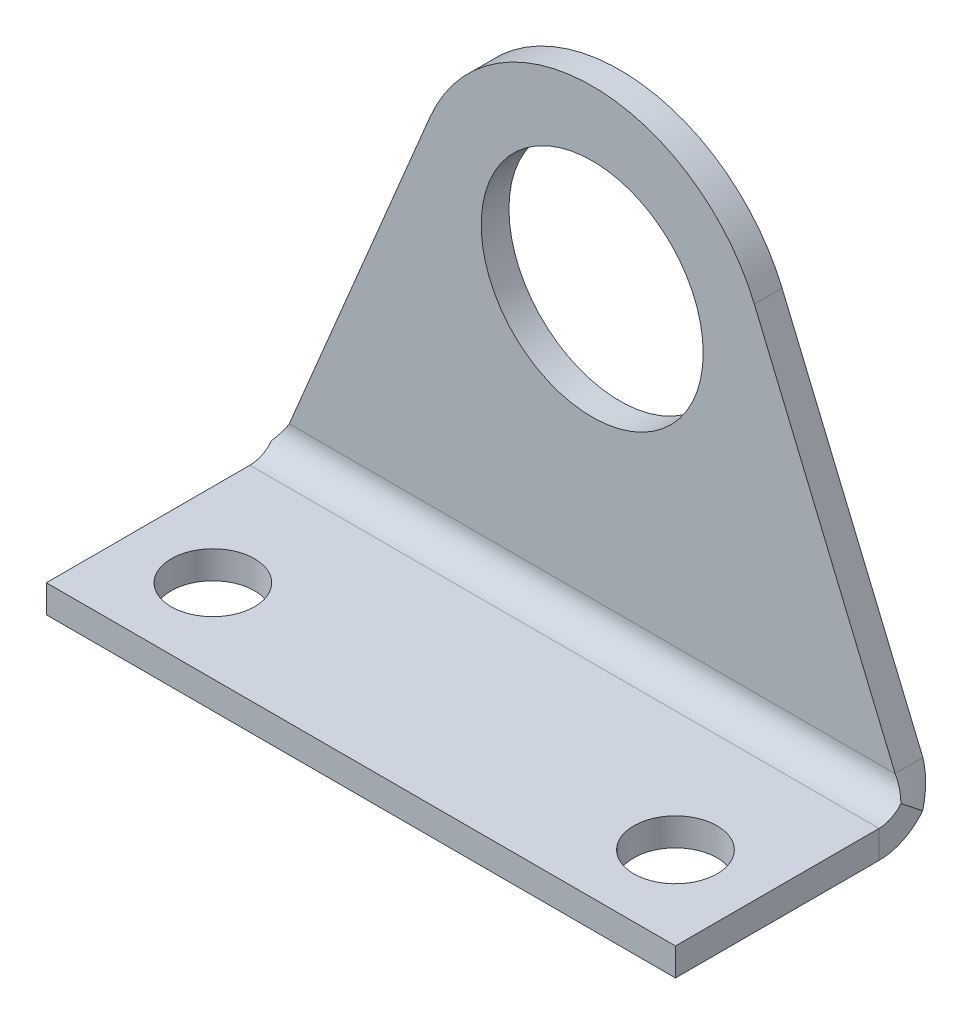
ISO-10303-21;
HEADER;
FILE_DESCRIPTION(('STEP AP214'),'2;1');
FILE_NAME('part.step','',(''),(''),'','','');
FILE_SCHEMA(('AUTOMOTIVE_DESIGN { 1 0 10303 214 1 1 1 1 }'));
ENDSEC;
DATA;
#1=APPLICATION_CONTEXT('core data for automotive mechanical design processes');
#2=APPLICATION_PROTOCOL_DEFINITION('international standard','automotive_design',2000,#1);
#3=PRODUCT_CONTEXT('',#1,'mechanical');
#4=PRODUCT('Part','Part','',(#3));
#5=PRODUCT_RELATED_PRODUCT_CATEGORY('part','',(#4));
#6=PRODUCT_DEFINITION_FORMATION('','',#4);
#7=PRODUCT_DEFINITION_CONTEXT('part definition',#1,'design');
#8=PRODUCT_DEFINITION('design','',#6,#7);
#9=PRODUCT_DEFINITION_SHAPE('','',#8);
#10=(LENGTH_UNIT() NAMED_UNIT(*) SI_UNIT(.MILLI.,.METRE.));
#11=(NAMED_UNIT(*) PLANE_ANGLE_UNIT() SI_UNIT($,.RADIAN.));
#12=(NAMED_UNIT(*) SI_UNIT($,.STERADIAN.) SOLID_ANGLE_UNIT());
#13=UNCERTAINTY_MEASURE_WITH_UNIT(LENGTH_MEASURE(1.E-05),#10,'distance_accuracy_value','');
#14=(GEOMETRIC_REPRESENTATION_CONTEXT(3) GLOBAL_UNCERTAINTY_ASSIGNED_CONTEXT((#13)) GLOBAL_UNIT_ASSIGNED_CONTEXT((#10,
#11,#12)) REPRESENTATION_CONTEXT('',''));
#15=CARTESIAN_POINT('',(0.,0.,0.));
#16=DIRECTION('',(0.,0.,1.));
#17=DIRECTION('',(1.,0.,0.));
#18=AXIS2_PLACEMENT_3D('',#15,#16,#17);
#19=CARTESIAN_POINT('',(17.,0.,82.6947319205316));
#20=DIRECTION('',(-0.922381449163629,-0.386280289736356,0.));
#21=DIRECTION('',(0.386280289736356,-0.922381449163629,0.));
#22=AXIS2_PLACEMENT_3D('',#19,#20,#21);
#23=PLANE('',#22);
#24=DIRECTION('',(-0.386280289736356,0.922381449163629,0.));
#25=VECTOR('',#24,1.);
#26=CARTESIAN_POINT('',(17.,0.,0.));
#27=LINE('',#26,#25);
#28=CARTESIAN_POINT('',(16.3718212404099,1.5,0.));
#29=VERTEX_POINT('',#28);
#30=CARTESIAN_POINT('',(8.76262376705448,19.6696627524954,0.));
#31=VERTEX_POINT('',#30);
#32=EDGE_CURVE('E50',#29,#31,#27,.T.);
#33=ORIENTED_EDGE('',*,*,#32,.T.);
#34=DIRECTION('',(0.,0.,-1.));
#35=VECTOR('',#34,1.);
#36=CARTESIAN_POINT('',(8.76262376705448,19.6696627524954,82.6947319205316));
#37=LINE('',#36,#35);
#38=CARTESIAN_POINT('',(8.76262376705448,19.6696627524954,1.5));
#39=VERTEX_POINT('',#38);
#40=EDGE_CURVE('E44',#39,#31,#37,.T.);
#41=ORIENTED_EDGE('',*,*,#40,.F.);
#42=DIRECTION('',(-0.386280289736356,0.922381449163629,0.));
#43=VECTOR('',#42,1.);
#44=CARTESIAN_POINT('',(17.,0.,1.5));
#45=LINE('',#44,#43);
#46=CARTESIAN_POINT('',(16.3718212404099,1.5,1.5));
#47=VERTEX_POINT('',#46);
#48=EDGE_CURVE('E316',#47,#39,#45,.T.);
#49=ORIENTED_EDGE('',*,*,#48,.F.);
#50=CARTESIAN_POINT('',(16.3718212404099,1.5,0.));
#51=CARTESIAN_POINT('',(16.3718212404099,1.5,1.5));
#52=B_SPLINE_CURVE_WITH_KNOTS('',1,(#50,#51),.UNSPECIFIED.,.F.,.F.,(2,2),(0.,1.),.UNSPECIFIED.);
#53=EDGE_CURVE('E11',#47,#29,#52,.F.);
#54=ORIENTED_EDGE('',*,*,#53,.T.);
#55=EDGE_LOOP('',(#33,#41,#49,#54));
#56=FACE_BOUND('',#55,.T.);
#57=ADVANCED_FACE('F35',(#56),#23,.F.);
#58=CARTESIAN_POINT('',(0.,16.,82.6947319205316));
#59=DIRECTION('',(0.,0.,-1.));
#60=DIRECTION('',(0.,1.,0.));
#61=AXIS2_PLACEMENT_3D('',#58,#59,#60);
#62=CYLINDRICAL_SURFACE('',#61,9.5);
#63=CARTESIAN_POINT('',(0.,16.,0.));
#64=DIRECTION('',(0.,0.,1.));
#65=DIRECTION('',(-1.,0.,0.));
#66=AXIS2_PLACEMENT_3D('',#63,#64,#65);
#67=CIRCLE('',#66,9.5);
#68=CARTESIAN_POINT('',(-8.76262376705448,19.6696627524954,0.));
#69=VERTEX_POINT('',#68);
#70=EDGE_CURVE('E310',#31,#69,#67,.T.);
#71=ORIENTED_EDGE('',*,*,#70,.T.);
#72=DIRECTION('',(0.,0.,-1.));
#73=VECTOR('',#72,1.);
#74=CARTESIAN_POINT('',(-8.76262376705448,19.6696627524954,82.6947319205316));
#75=LINE('',#74,#73);
#76=CARTESIAN_POINT('',(-8.76262376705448,19.6696627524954,1.5));
#77=VERTEX_POINT('',#76);
#78=EDGE_CURVE('E323',#77,#69,#75,.T.);
#79=ORIENTED_EDGE('',*,*,#78,.F.);
#80=CARTESIAN_POINT('',(0.,16.,1.5));
#81=DIRECTION('',(0.,0.,1.));
#82=DIRECTION('',(-1.,0.,0.));
#83=AXIS2_PLACEMENT_3D('',#80,#81,#82);
#84=CIRCLE('',#83,9.5);
#85=EDGE_CURVE('E58',#39,#77,#84,.T.);
#86=ORIENTED_EDGE('',*,*,#85,.F.);
#87=ORIENTED_EDGE('',*,*,#40,.T.);
#88=EDGE_LOOP('',(#71,#79,#86,#87));
#89=FACE_BOUND('',#88,.T.);
#90=ADVANCED_FACE('F366',(#89),#62,.T.);
#91=CARTESIAN_POINT('',(-8.76262376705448,19.6696627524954,82.6947319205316));
#92=DIRECTION('',(0.922381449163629,-0.386280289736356,0.));
#93=DIRECTION('',(0.386280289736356,0.922381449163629,0.));
#94=AXIS2_PLACEMENT_3D('',#91,#92,#93);
#95=PLANE('',#94);
#96=DIRECTION('',(-0.386280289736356,-0.922381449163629,0.));
#97=VECTOR('',#96,1.);
#98=CARTESIAN_POINT('',(-8.76262376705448,19.6696627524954,0.));
#99=LINE('',#98,#97);
#100=CARTESIAN_POINT('',(-16.3718212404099,1.49999999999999,0.));
#101=VERTEX_POINT('',#100);
#102=EDGE_CURVE('E328',#69,#101,#99,.T.);
#103=ORIENTED_EDGE('',*,*,#102,.T.);
#104=CARTESIAN_POINT('',(-16.3718212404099,1.5,1.5));
#105=CARTESIAN_POINT('',(-16.3718212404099,1.49999999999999,0.));
#106=B_SPLINE_CURVE_WITH_KNOTS('',1,(#104,#105),.UNSPECIFIED.,.F.,.F.,(2,2),(0.,1.),.UNSPECIFIED.);
#107=CARTESIAN_POINT('',(-16.3718212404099,1.5,1.5));
#108=VERTEX_POINT('',#107);
#109=EDGE_CURVE('E325',#108,#101,#106,.T.);
#110=ORIENTED_EDGE('',*,*,#109,.F.);
#111=DIRECTION('',(-0.386280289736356,-0.922381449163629,0.));
#112=VECTOR('',#111,1.);
#113=CARTESIAN_POINT('',(-8.76262376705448,19.6696627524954,1.5));
#114=LINE('',#113,#112);
#115=EDGE_CURVE('E314',#77,#108,#114,.T.);
#116=ORIENTED_EDGE('',*,*,#115,.F.);
#117=ORIENTED_EDGE('',*,*,#78,.T.);
#118=EDGE_LOOP('',(#103,#110,#116,#117));
#119=FACE_BOUND('',#118,.T.);
#120=ADVANCED_FACE('F356',(#119),#95,.F.);
#121=CARTESIAN_POINT('',(0.,16.,1.5));
#122=DIRECTION('',(0.,0.,-1.));
#123=DIRECTION('',(-1.,0.,0.));
#124=AXIS2_PLACEMENT_3D('',#121,#122,#123);
#125=PLANE('',#124);
#126=CARTESIAN_POINT('',(0.,16.,1.5));
#127=DIRECTION('',(0.,0.,1.));
#128=DIRECTION('',(1.,0.,0.));
#129=AXIS2_PLACEMENT_3D('',#126,#127,#128);
#130=CIRCLE('',#129,6.);
#131=CARTESIAN_POINT('',(6.,16.,1.5));
#132=VERTEX_POINT('',#131);
#133=EDGE_CURVE('E382',#132,#132,#130,.T.);
#134=ORIENTED_EDGE('',*,*,#133,.F.);
#135=EDGE_LOOP('',(#134));
#136=FACE_BOUND('',#135,.T.);
#137=ORIENTED_EDGE('',*,*,#115,.T.);
#138=DIRECTION('',(1.,0.,0.));
#139=VECTOR('',#138,1.);
#140=CARTESIAN_POINT('',(16.3718212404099,1.5,1.5));
#141=LINE('',#140,#139);
#142=EDGE_CURVE('E322',#108,#47,#141,.T.);
#143=ORIENTED_EDGE('',*,*,#142,.T.);
#144=ORIENTED_EDGE('',*,*,#48,.T.);
#145=ORIENTED_EDGE('',*,*,#85,.T.);
#146=EDGE_LOOP('',(#137,#143,#144,#145));
#147=FACE_BOUND('',#146,.T.);
#148=ADVANCED_FACE('F365',(#136,#147),#125,.F.);
#149=CARTESIAN_POINT('',(0.,16.,0.));
#150=DIRECTION('',(0.,0.,-1.));
#151=DIRECTION('',(-1.,0.,0.));
#152=AXIS2_PLACEMENT_3D('',#149,#150,#151);
#153=PLANE('',#152);
#154=CARTESIAN_POINT('',(0.,16.,0.));
#155=DIRECTION('',(0.,0.,-1.));
#156=DIRECTION('',(-1.,0.,0.));
#157=AXIS2_PLACEMENT_3D('',#154,#155,#156);
#158=CIRCLE('',#157,6.);
#159=CARTESIAN_POINT('',(-6.,16.,0.));
#160=VERTEX_POINT('',#159);
#161=EDGE_CURVE('E379',#160,#160,#158,.T.);
#162=ORIENTED_EDGE('',*,*,#161,.F.);
#163=EDGE_LOOP('',(#162));
#164=FACE_BOUND('',#163,.T.);
#165=DIRECTION('',(1.,0.,0.));
#166=VECTOR('',#165,1.);
#167=CARTESIAN_POINT('',(16.3718212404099,1.5,0.));
#168=LINE('',#167,#166);
#169=EDGE_CURVE('E140',#101,#29,#168,.T.);
#170=ORIENTED_EDGE('',*,*,#169,.F.);
#171=ORIENTED_EDGE('',*,*,#102,.F.);
#172=ORIENTED_EDGE('',*,*,#70,.F.);
#173=ORIENTED_EDGE('',*,*,#32,.F.);
#174=EDGE_LOOP('',(#170,#171,#172,#173));
#175=FACE_BOUND('',#174,.T.);
#176=ADVANCED_FACE('F377',(#164,#175),#153,.T.);
#177=CARTESIAN_POINT('',(17.,71.4702735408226,14.));
#178=DIRECTION('',(-1.,0.,0.));
#179=DIRECTION('',(0.,0.,1.));
#180=AXIS2_PLACEMENT_3D('',#177,#178,#179);
#181=PLANE('',#180);
#182=DIRECTION('',(0.,0.,-1.));
#183=VECTOR('',#182,1.);
#184=CARTESIAN_POINT('',(17.,-1.5,14.));
#185=LINE('',#184,#183);
#186=CARTESIAN_POINT('',(17.,-1.5,14.));
#187=VERTEX_POINT('',#186);
#188=CARTESIAN_POINT('',(17.,-1.5,3.));
#189=VERTEX_POINT('',#188);
#190=EDGE_CURVE('E269',#187,#189,#185,.T.);
#191=ORIENTED_EDGE('',*,*,#190,.T.);
#192=DIRECTION('',(0.,-1.,0.));
#193=VECTOR('',#192,1.);
#194=CARTESIAN_POINT('',(17.,71.4702735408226,3.));
#195=LINE('',#194,#193);
#196=CARTESIAN_POINT('',(17.,0.,3.));
#197=VERTEX_POINT('',#196);
#198=EDGE_CURVE('E147',#197,#189,#195,.T.);
#199=ORIENTED_EDGE('',*,*,#198,.F.);
#200=DIRECTION('',(0.,0.,-1.));
#201=VECTOR('',#200,1.);
#202=CARTESIAN_POINT('',(17.,0.,14.));
#203=LINE('',#202,#201);
#204=CARTESIAN_POINT('',(17.,0.,14.));
#205=VERTEX_POINT('',#204);
#206=EDGE_CURVE('E293',#205,#197,#203,.T.);
#207=ORIENTED_EDGE('',*,*,#206,.F.);
#208=DIRECTION('',(0.,-1.,0.));
#209=VECTOR('',#208,1.);
#210=CARTESIAN_POINT('',(17.,71.4702735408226,14.));
#211=LINE('',#210,#209);
#212=EDGE_CURVE('E301',#205,#187,#211,.T.);
#213=ORIENTED_EDGE('',*,*,#212,.T.);
#214=EDGE_LOOP('',(#191,#199,#207,#213));
#215=FACE_BOUND('',#214,.T.);
#216=ADVANCED_FACE('F416',(#215),#181,.F.);
#217=CARTESIAN_POINT('',(-17.,71.4702735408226,14.));
#218=DIRECTION('',(-1.,0.,0.));
#219=DIRECTION('',(0.,0.,1.));
#220=AXIS2_PLACEMENT_3D('',#217,#218,#219);
#221=PLANE('',#220);
#222=DIRECTION('',(0.,-1.,0.));
#223=VECTOR('',#222,1.);
#224=CARTESIAN_POINT('',(-17.,71.4702735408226,3.));
#225=LINE('',#224,#223);
#226=CARTESIAN_POINT('',(-17.,0.,3.));
#227=VERTEX_POINT('',#226);
#228=CARTESIAN_POINT('',(-17.,-1.5,3.));
#229=VERTEX_POINT('',#228);
#230=EDGE_CURVE('E306',#227,#229,#225,.T.);
#231=ORIENTED_EDGE('',*,*,#230,.T.);
#232=DIRECTION('',(0.,0.,-1.));
#233=VECTOR('',#232,1.);
#234=CARTESIAN_POINT('',(-17.,-1.5,14.));
#235=LINE('',#234,#233);
#236=CARTESIAN_POINT('',(-17.,-1.5,14.));
#237=VERTEX_POINT('',#236);
#238=EDGE_CURVE('E280',#237,#229,#235,.T.);
#239=ORIENTED_EDGE('',*,*,#238,.F.);
#240=DIRECTION('',(0.,-1.,0.));
#241=VECTOR('',#240,1.);
#242=CARTESIAN_POINT('',(-17.,71.4702735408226,14.));
#243=LINE('',#242,#241);
#244=CARTESIAN_POINT('',(-17.,0.,14.));
#245=VERTEX_POINT('',#244);
#246=EDGE_CURVE('E304',#245,#237,#243,.T.);
#247=ORIENTED_EDGE('',*,*,#246,.F.);
#248=DIRECTION('',(0.,0.,-1.));
#249=VECTOR('',#248,1.);
#250=CARTESIAN_POINT('',(-17.,0.,14.));
#251=LINE('',#250,#249);
#252=EDGE_CURVE('E285',#245,#227,#251,.T.);
#253=ORIENTED_EDGE('',*,*,#252,.T.);
#254=EDGE_LOOP('',(#231,#239,#247,#253));
#255=FACE_BOUND('',#254,.T.);
#256=ADVANCED_FACE('F411',(#255),#221,.T.);
#257=CARTESIAN_POINT('',(-17.,71.4702735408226,14.));
#258=DIRECTION('',(0.,0.,-1.));
#259=DIRECTION('',(-1.,0.,0.));
#260=AXIS2_PLACEMENT_3D('',#257,#258,#259);
#261=PLANE('',#260);
#262=DIRECTION('',(-1.,0.,0.));
#263=VECTOR('',#262,1.);
#264=CARTESIAN_POINT('',(-17.,-1.5,14.));
#265=LINE('',#264,#263);
#266=EDGE_CURVE('E277',#187,#237,#265,.T.);
#267=ORIENTED_EDGE('',*,*,#266,.F.);
#268=ORIENTED_EDGE('',*,*,#212,.F.);
#269=DIRECTION('',(1.,0.,0.));
#270=VECTOR('',#269,1.);
#271=CARTESIAN_POINT('',(-17.,0.,14.));
#272=LINE('',#271,#270);
#273=EDGE_CURVE('E288',#245,#205,#272,.T.);
#274=ORIENTED_EDGE('',*,*,#273,.F.);
#275=ORIENTED_EDGE('',*,*,#246,.T.);
#276=EDGE_LOOP('',(#267,#268,#274,#275));
#277=FACE_BOUND('',#276,.T.);
#278=ADVANCED_FACE('F418',(#277),#261,.F.);
#279=CARTESIAN_POINT('',(-17.,0.,14.));
#280=DIRECTION('',(0.,1.,0.));
#281=DIRECTION('',(0.,0.,1.));
#282=AXIS2_PLACEMENT_3D('',#279,#280,#281);
#283=PLANE('',#282);
#284=CARTESIAN_POINT('',(12.5,0.,9.5));
#285=DIRECTION('',(0.,1.,0.));
#286=DIRECTION('',(0.,0.,1.));
#287=AXIS2_PLACEMENT_3D('',#284,#285,#286);
#288=CIRCLE('',#287,2.25);
#289=CARTESIAN_POINT('',(12.5,0.,11.75));
#290=VERTEX_POINT('',#289);
#291=EDGE_CURVE('E391',#290,#290,#288,.T.);
#292=ORIENTED_EDGE('',*,*,#291,.F.);
#293=EDGE_LOOP('',(#292));
#294=FACE_BOUND('',#293,.T.);
#295=CARTESIAN_POINT('',(-12.5,0.,9.5));
#296=DIRECTION('',(0.,1.,0.));
#297=DIRECTION('',(0.,0.,1.));
#298=AXIS2_PLACEMENT_3D('',#295,#296,#297);
#299=CIRCLE('',#298,2.25);
#300=CARTESIAN_POINT('',(-12.5,0.,11.75));
#301=VERTEX_POINT('',#300);
#302=EDGE_CURVE('E388',#301,#301,#299,.T.);
#303=ORIENTED_EDGE('',*,*,#302,.F.);
#304=EDGE_LOOP('',(#303));
#305=FACE_BOUND('',#304,.T.);
#306=ORIENTED_EDGE('',*,*,#206,.T.);
#307=DIRECTION('',(-1.,0.,0.));
#308=VECTOR('',#307,1.);
#309=CARTESIAN_POINT('',(17.,0.,3.));
#310=LINE('',#309,#308);
#311=EDGE_CURVE('E296',#197,#227,#310,.T.);
#312=ORIENTED_EDGE('',*,*,#311,.T.);
#313=ORIENTED_EDGE('',*,*,#252,.F.);
#314=ORIENTED_EDGE('',*,*,#273,.T.);
#315=EDGE_LOOP('',(#306,#312,#313,#314));
#316=FACE_BOUND('',#315,.T.);
#317=ADVANCED_FACE('F403',(#294,#305,#316),#283,.T.);
#318=CARTESIAN_POINT('',(-17.,-1.5,14.));
#319=DIRECTION('',(0.,-1.,0.));
#320=DIRECTION('',(1.,0.,0.));
#321=AXIS2_PLACEMENT_3D('',#318,#319,#320);
#322=PLANE('',#321);
#323=CARTESIAN_POINT('',(12.5,-1.5,9.5));
#324=DIRECTION('',(0.,-1.,0.));
#325=DIRECTION('',(1.,0.,0.));
#326=AXIS2_PLACEMENT_3D('',#323,#324,#325);
#327=CIRCLE('',#326,2.25);
#328=CARTESIAN_POINT('',(14.75,-1.5,9.5));
#329=VERTEX_POINT('',#328);
#330=EDGE_CURVE('E39',#329,#329,#327,.T.);
#331=ORIENTED_EDGE('',*,*,#330,.F.);
#332=EDGE_LOOP('',(#331));
#333=FACE_BOUND('',#332,.T.);
#334=CARTESIAN_POINT('',(-12.5,-1.5,9.5));
#335=DIRECTION('',(0.,-1.,0.));
#336=DIRECTION('',(1.,0.,0.));
#337=AXIS2_PLACEMENT_3D('',#334,#335,#336);
#338=CIRCLE('',#337,2.25);
#339=CARTESIAN_POINT('',(-10.25,-1.5,9.5));
#340=VERTEX_POINT('',#339);
#341=EDGE_CURVE('E387',#340,#340,#338,.T.);
#342=ORIENTED_EDGE('',*,*,#341,.F.);
#343=EDGE_LOOP('',(#342));
#344=FACE_BOUND('',#343,.T.);
#345=ORIENTED_EDGE('',*,*,#238,.T.);
#346=DIRECTION('',(1.,0.,0.));
#347=VECTOR('',#346,1.);
#348=CARTESIAN_POINT('',(17.,-1.5,3.));
#349=LINE('',#348,#347);
#350=EDGE_CURVE('E283',#229,#189,#349,.T.);
#351=ORIENTED_EDGE('',*,*,#350,.T.);
#352=ORIENTED_EDGE('',*,*,#190,.F.);
#353=ORIENTED_EDGE('',*,*,#266,.T.);
#354=EDGE_LOOP('',(#345,#351,#352,#353));
#355=FACE_BOUND('',#354,.T.);
#356=ADVANCED_FACE('F400',(#333,#344,#355),#322,.T.);
#357=CARTESIAN_POINT('',(-17.,1.5,3.));
#358=DIRECTION('',(-1.,0.,0.));
#359=DIRECTION('',(0.,-1.,0.));
#360=AXIS2_PLACEMENT_3D('',#357,#358,#359);
#361=PLANE('',#360);
#362=ORIENTED_EDGE('',*,*,#230,.F.);
#363=CARTESIAN_POINT('',(-17.,1.5,3.));
#364=DIRECTION('',(-1.,0.,0.));
#365=DIRECTION('',(0.,0.,1.));
#366=AXIS2_PLACEMENT_3D('',#363,#364,#365);
#367=CIRCLE('',#366,1.5);
#368=CARTESIAN_POINT('',(-17.,0.572445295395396,1.82116910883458));
#369=VERTEX_POINT('',#368);
#370=EDGE_CURVE('E148',#227,#369,#367,.F.);
#371=ORIENTED_EDGE('',*,*,#370,.T.);
#372=CARTESIAN_POINT('',(-17.,-0.355109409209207,0.642338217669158));
#373=CARTESIAN_POINT('',(-17.,0.572445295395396,1.82116910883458));
#374=B_SPLINE_CURVE_WITH_KNOTS('',1,(#372,#373),.UNSPECIFIED.,.F.,.F.,(2,2),(0.,1.),.UNSPECIFIED.);
#375=CARTESIAN_POINT('',(-17.,-0.355109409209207,0.642338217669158));
#376=VERTEX_POINT('',#375);
#377=EDGE_CURVE('E128',#369,#376,#374,.F.);
#378=ORIENTED_EDGE('',*,*,#377,.T.);
#379=CARTESIAN_POINT('',(-17.,1.5,3.));
#380=DIRECTION('',(-1.,0.,0.));
#381=DIRECTION('',(0.,0.,1.));
#382=AXIS2_PLACEMENT_3D('',#379,#380,#381);
#383=CIRCLE('',#382,3.);
#384=EDGE_CURVE('E129',#229,#376,#383,.F.);
#385=ORIENTED_EDGE('',*,*,#384,.F.);
#386=EDGE_LOOP('',(#362,#371,#378,#385));
#387=FACE_BOUND('',#386,.T.);
#388=ADVANCED_FACE('F227',(#387),#361,.T.);
#389=CARTESIAN_POINT('',(-17.,-0.355109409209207,0.642338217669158));
#390=CARTESIAN_POINT('',(-16.8952945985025,-0.0931246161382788,0.436197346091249));
#391=CARTESIAN_POINT('',(-16.7906070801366,0.203430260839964,0.274194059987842));
#392=CARTESIAN_POINT('',(-16.5812141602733,0.833401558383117,0.0560642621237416));
#393=CARTESIAN_POINT('',(-16.4765266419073,1.16663819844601,0.));
#394=CARTESIAN_POINT('',(-16.3718212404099,1.49999999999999,0.));
#395=CARTESIAN_POINT('',(-17.,0.572445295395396,1.82116910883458));
#396=CARTESIAN_POINT('',(-16.8952964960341,0.703435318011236,1.7181005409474));
#397=CARTESIAN_POINT('',(-16.7906070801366,0.851715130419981,1.63709702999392));
#398=CARTESIAN_POINT('',(-16.5812141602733,1.16670077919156,1.52803213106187));
#399=CARTESIAN_POINT('',(-16.4765247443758,1.33332211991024,1.5));
#400=CARTESIAN_POINT('',(-16.3718212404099,1.5,1.5));
#401=B_SPLINE_SURFACE_WITH_KNOTS('',1,3,((#389,#390,#391,#392,#393,#394),(#395,#396,#397,#398,
#399,#400)),.UNSPECIFIED.,.F.,.F.,.F.,(2,2),(4,2,4),(0.,1.),(0.,0.5,1.),.UNSPECIFIED.);
#402=CARTESIAN_POINT('',(-17.,0.572445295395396,1.82116910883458));
#403=CARTESIAN_POINT('',(-16.8952964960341,0.703435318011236,1.7181005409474));
#404=CARTESIAN_POINT('',(-16.7906070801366,0.851715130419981,1.63709702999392));
#405=CARTESIAN_POINT('',(-16.5812141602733,1.16670077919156,1.52803213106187));
#406=CARTESIAN_POINT('',(-16.4765247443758,1.33332211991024,1.5));
#407=CARTESIAN_POINT('',(-16.3718212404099,1.5,1.5));
#408=B_SPLINE_CURVE_WITH_KNOTS('',3,(#402,#403,#404,#405,#406,#407),.UNSPECIFIED.,.F.,.F.,(4,2,
4),(0.,0.5,1.),.UNSPECIFIED.);
#409=EDGE_CURVE('E151',#369,#108,#408,.T.);
#410=CARTESIAN_POINT('',(-16.3718212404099,1.49999999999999,0.));
#411=CARTESIAN_POINT('',(-16.4765266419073,1.16663819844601,0.));
#412=CARTESIAN_POINT('',(-16.5812141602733,0.833401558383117,0.0560642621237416));
#413=CARTESIAN_POINT('',(-16.7906070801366,0.203430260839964,0.274194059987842));
#414=CARTESIAN_POINT('',(-16.8952945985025,-0.0931246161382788,0.436197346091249));
#415=CARTESIAN_POINT('',(-17.,-0.355109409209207,0.642338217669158));
#416=B_SPLINE_CURVE_WITH_KNOTS('',3,(#410,#411,#412,#413,#414,#415),.UNSPECIFIED.,.F.,.F.,(4,2,
4),(0.,0.5,1.),.UNSPECIFIED.);
#417=EDGE_CURVE('E141',#376,#101,#416,.F.);
#418=ORIENTED_EDGE('',*,*,#377,.F.);
#419=ORIENTED_EDGE('',*,*,#409,.T.);
#420=ORIENTED_EDGE('',*,*,#109,.T.);
#421=ORIENTED_EDGE('',*,*,#417,.F.);
#422=EDGE_LOOP('',(#418,#419,#420,#421));
#423=FACE_BOUND('',#422,.T.);
#424=ADVANCED_FACE('F216',(#423),#401,.T.);
#425=CARTESIAN_POINT('',(16.3718212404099,1.5,0.));
#426=CARTESIAN_POINT('',(16.4765266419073,1.16663819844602,0.));
#427=CARTESIAN_POINT('',(16.5812141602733,0.833401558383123,0.0560642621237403));
#428=CARTESIAN_POINT('',(16.7906070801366,0.203430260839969,0.27419405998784));
#429=CARTESIAN_POINT('',(16.8952945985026,-0.0931246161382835,0.436197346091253));
#430=CARTESIAN_POINT('',(17.,-0.355109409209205,0.642338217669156));
#431=CARTESIAN_POINT('',(16.3718212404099,1.5,1.5));
#432=CARTESIAN_POINT('',(16.4765247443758,1.33332211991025,1.5));
#433=CARTESIAN_POINT('',(16.5812141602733,1.16670077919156,1.52803213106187));
#434=CARTESIAN_POINT('',(16.7906070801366,0.851715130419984,1.63709702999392));
#435=CARTESIAN_POINT('',(16.8952964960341,0.703435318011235,1.7181005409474));
#436=CARTESIAN_POINT('',(17.,0.572445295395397,1.82116910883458));
#437=B_SPLINE_SURFACE_WITH_KNOTS('',1,3,((#425,#426,#427,#428,#429,#430),(#431,#432,#433,#434,
#435,#436)),.UNSPECIFIED.,.F.,.F.,.F.,(2,2),(4,2,4),(0.,1.),(0.,0.5,1.),.UNSPECIFIED.);
#438=CARTESIAN_POINT('',(16.3718212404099,1.5,1.5));
#439=CARTESIAN_POINT('',(16.4765247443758,1.33332211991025,1.5));
#440=CARTESIAN_POINT('',(16.5812141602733,1.16670077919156,1.52803213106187));
#441=CARTESIAN_POINT('',(16.7906070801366,0.851715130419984,1.63709702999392));
#442=CARTESIAN_POINT('',(16.8952964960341,0.703435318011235,1.7181005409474));
#443=CARTESIAN_POINT('',(17.,0.572445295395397,1.82116910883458));
#444=B_SPLINE_CURVE_WITH_KNOTS('',3,(#438,#439,#440,#441,#442,#443),.UNSPECIFIED.,.F.,.F.,(4,2,
4),(0.,0.5,1.),.UNSPECIFIED.);
#445=CARTESIAN_POINT('',(17.,0.572445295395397,1.82116910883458));
#446=VERTEX_POINT('',#445);
#447=EDGE_CURVE('E122',#47,#446,#444,.T.);
#448=CARTESIAN_POINT('',(17.,0.572445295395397,1.82116910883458));
#449=CARTESIAN_POINT('',(17.,-0.355109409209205,0.642338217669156));
#450=B_SPLINE_CURVE_WITH_KNOTS('',1,(#448,#449),.UNSPECIFIED.,.F.,.F.,(2,2),(0.,1.),.UNSPECIFIED.);
#451=CARTESIAN_POINT('',(17.,-0.355109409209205,0.642338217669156));
#452=VERTEX_POINT('',#451);
#453=EDGE_CURVE('E114',#446,#452,#450,.T.);
#454=CARTESIAN_POINT('',(17.,-0.355109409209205,0.642338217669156));
#455=CARTESIAN_POINT('',(16.8952945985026,-0.0931246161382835,0.436197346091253));
#456=CARTESIAN_POINT('',(16.7906070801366,0.203430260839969,0.27419405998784));
#457=CARTESIAN_POINT('',(16.5812141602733,0.833401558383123,0.0560642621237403));
#458=CARTESIAN_POINT('',(16.4765266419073,1.16663819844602,0.));
#459=CARTESIAN_POINT('',(16.3718212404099,1.5,0.));
#460=B_SPLINE_CURVE_WITH_KNOTS('',3,(#454,#455,#456,#457,#458,#459),.UNSPECIFIED.,.F.,.F.,(4,2,
4),(0.,0.5,1.),.UNSPECIFIED.);
#461=EDGE_CURVE('E118',#29,#452,#460,.F.);
#462=ORIENTED_EDGE('',*,*,#53,.F.);
#463=ORIENTED_EDGE('',*,*,#447,.T.);
#464=ORIENTED_EDGE('',*,*,#453,.T.);
#465=ORIENTED_EDGE('',*,*,#461,.F.);
#466=EDGE_LOOP('',(#462,#463,#464,#465));
#467=FACE_BOUND('',#466,.T.);
#468=ADVANCED_FACE('F117',(#467),#437,.T.);
#469=CARTESIAN_POINT('',(17.,1.5,3.));
#470=DIRECTION('',(1.,0.,0.));
#471=DIRECTION('',(0.,1.,0.));
#472=AXIS2_PLACEMENT_3D('',#469,#470,#471);
#473=PLANE('',#472);
#474=ORIENTED_EDGE('',*,*,#453,.F.);
#475=CARTESIAN_POINT('',(17.,1.5,3.));
#476=DIRECTION('',(-1.,0.,0.));
#477=DIRECTION('',(0.,0.,1.));
#478=AXIS2_PLACEMENT_3D('',#475,#476,#477);
#479=CIRCLE('',#478,1.5);
#480=EDGE_CURVE('E378',#446,#197,#479,.T.);
#481=ORIENTED_EDGE('',*,*,#480,.T.);
#482=ORIENTED_EDGE('',*,*,#198,.T.);
#483=CARTESIAN_POINT('',(17.,1.5,3.));
#484=DIRECTION('',(-1.,0.,0.));
#485=DIRECTION('',(0.,0.,1.));
#486=AXIS2_PLACEMENT_3D('',#483,#484,#485);
#487=CIRCLE('',#486,3.);
#488=EDGE_CURVE('E136',#452,#189,#487,.T.);
#489=ORIENTED_EDGE('',*,*,#488,.F.);
#490=EDGE_LOOP('',(#474,#481,#482,#489));
#491=FACE_BOUND('',#490,.T.);
#492=ADVANCED_FACE('F145',(#491),#473,.T.);
#493=CARTESIAN_POINT('',(68.4114932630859,1.5,3.));
#494=DIRECTION('',(-1.,0.,0.));
#495=DIRECTION('',(0.,0.,1.));
#496=AXIS2_PLACEMENT_3D('',#493,#494,#495);
#497=CYLINDRICAL_SURFACE('',#496,3.);
#498=ORIENTED_EDGE('',*,*,#488,.T.);
#499=ORIENTED_EDGE('',*,*,#350,.F.);
#500=ORIENTED_EDGE('',*,*,#384,.T.);
#501=ORIENTED_EDGE('',*,*,#417,.T.);
#502=ORIENTED_EDGE('',*,*,#169,.T.);
#503=ORIENTED_EDGE('',*,*,#461,.T.);
#504=EDGE_LOOP('',(#498,#499,#500,#501,#502,#503));
#505=FACE_BOUND('',#504,.T.);
#506=ADVANCED_FACE('F135',(#505),#497,.T.);
#507=CARTESIAN_POINT('',(68.4114932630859,1.5,3.));
#508=DIRECTION('',(-1.,0.,0.));
#509=DIRECTION('',(0.,0.,1.));
#510=AXIS2_PLACEMENT_3D('',#507,#508,#509);
#511=CYLINDRICAL_SURFACE('',#510,1.5);
#512=ORIENTED_EDGE('',*,*,#480,.F.);
#513=ORIENTED_EDGE('',*,*,#447,.F.);
#514=ORIENTED_EDGE('',*,*,#142,.F.);
#515=ORIENTED_EDGE('',*,*,#409,.F.);
#516=ORIENTED_EDGE('',*,*,#370,.F.);
#517=ORIENTED_EDGE('',*,*,#311,.F.);
#518=EDGE_LOOP('',(#512,#513,#514,#515,#516,#517));
#519=FACE_BOUND('',#518,.T.);
#520=ADVANCED_FACE('F169',(#519),#511,.F.);
#521=CARTESIAN_POINT('',(0.,16.,-0.00377499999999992));
#522=DIRECTION('',(0.,0.,1.));
#523=DIRECTION('',(1.,0.,0.));
#524=AXIS2_PLACEMENT_3D('',#521,#522,#523);
#525=CYLINDRICAL_SURFACE('',#524,6.);
#526=ORIENTED_EDGE('',*,*,#161,.T.);
#527=EDGE_LOOP('',(#526));
#528=FACE_BOUND('',#527,.T.);
#529=ORIENTED_EDGE('',*,*,#133,.T.);
#530=EDGE_LOOP('',(#529));
#531=FACE_BOUND('',#530,.T.);
#532=ADVANCED_FACE('F170',(#528,#531),#525,.F.);
#533=CARTESIAN_POINT('',(-12.5,-1.500025,9.5));
#534=DIRECTION('',(0.,1.,0.));
#535=DIRECTION('',(0.,0.,1.));
#536=AXIS2_PLACEMENT_3D('',#533,#534,#535);
#537=CYLINDRICAL_SURFACE('',#536,2.25);
#538=ORIENTED_EDGE('',*,*,#341,.T.);
#539=EDGE_LOOP('',(#538));
#540=FACE_BOUND('',#539,.T.);
#541=ORIENTED_EDGE('',*,*,#302,.T.);
#542=EDGE_LOOP('',(#541));
#543=FACE_BOUND('',#542,.T.);
#544=ADVANCED_FACE('F440',(#540,#543),#537,.F.);
#545=CARTESIAN_POINT('',(12.5,-1.500025,9.5));
#546=DIRECTION('',(0.,1.,0.));
#547=DIRECTION('',(0.,0.,1.));
#548=AXIS2_PLACEMENT_3D('',#545,#546,#547);
#549=CYLINDRICAL_SURFACE('',#548,2.25);
#550=ORIENTED_EDGE('',*,*,#330,.T.);
#551=EDGE_LOOP('',(#550));
#552=FACE_BOUND('',#551,.T.);
#553=ORIENTED_EDGE('',*,*,#291,.T.);
#554=EDGE_LOOP('',(#553));
#555=FACE_BOUND('',#554,.T.);
#556=ADVANCED_FACE('F398',(#552,#555),#549,.F.);
#557=CLOSED_SHELL('',(#57,#90,#120,#148,#176,#216,#256,#278,#317,#356,#388,#424,#468,#492,#506,
#520,#532,#544,#556));
#558=MANIFOLD_SOLID_BREP('B2',#557);
#559=ADVANCED_BREP_SHAPE_REPRESENTATION('',(#18,#558),#14);
#560=SHAPE_DEFINITION_REPRESENTATION(#9,#559);
ENDSEC;
END-ISO-10303-21;
